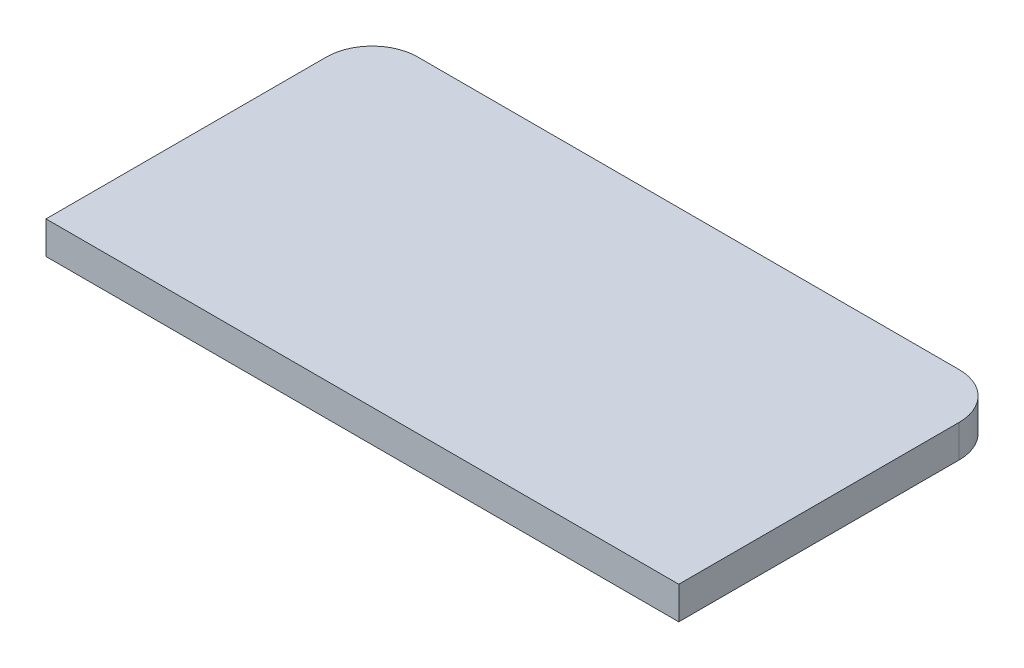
from build123d import *

# Parameters (mm, degrees)
BOSS_EXTRUDE1_DEPTH = 3.175


with BuildPart() as part:
    # Sketch1 → Boss-Extrude1 (new body)
    with BuildSketch(Plane(origin=(0, 0, 0), x_dir=(1, 0, 0), z_dir=(0, 1, 0))):
        with BuildLine():
            Line((-26.3621774, 4.445), (26.3621774, 4.445))
            ThreePointArc((26.3621774, 4.445), (29.505267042, 3.143089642), (30.8071774, 0))
            Line((30.8071774, 0), (30.8071774, -27.305))
            Line((30.8071774, -27.305), (-30.8071774, -27.305))
            Line((-30.8071774, -27.305), (-30.8071774, 0))
            ThreePointArc((-30.8071774, 0), (-29.505267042, 3.143089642), (-26.3621774, 4.445))
        make_face()
    extrude(amount=BOSS_EXTRUDE1_DEPTH)


solid = part.part
